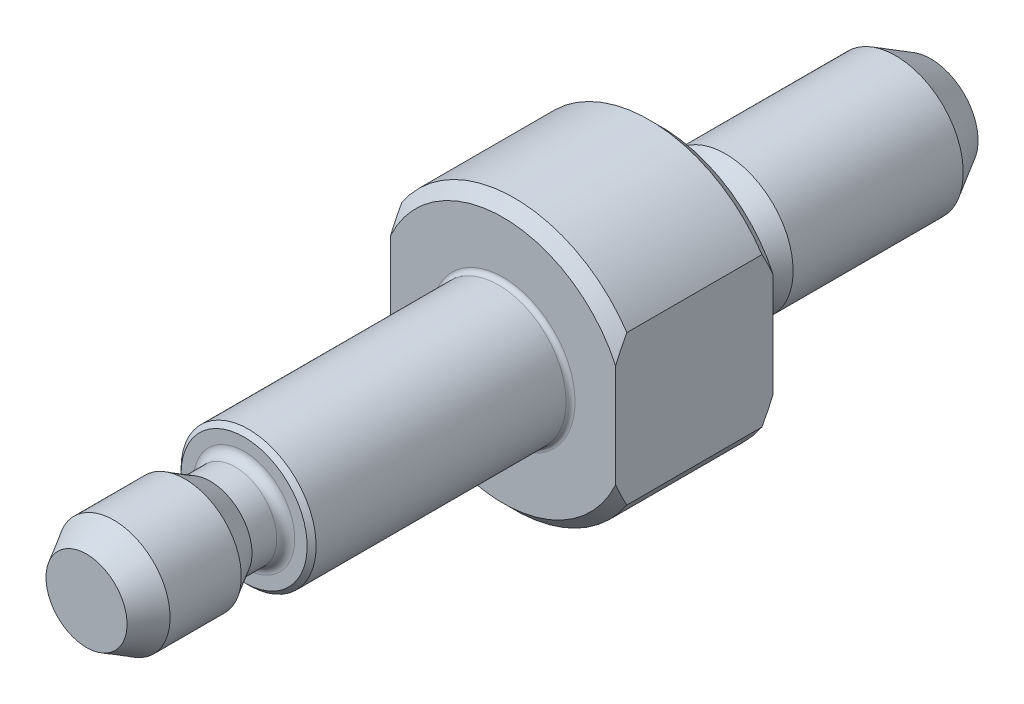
ISO-10303-21;
HEADER;
FILE_DESCRIPTION(('STEP AP214'),'2;1');
FILE_NAME('part.step','',(''),(''),'','','');
FILE_SCHEMA(('AUTOMOTIVE_DESIGN { 1 0 10303 214 1 1 1 1 }'));
ENDSEC;
DATA;
#1=APPLICATION_CONTEXT('core data for automotive mechanical design processes');
#2=APPLICATION_PROTOCOL_DEFINITION('international standard','automotive_design',2000,#1);
#3=PRODUCT_CONTEXT('',#1,'mechanical');
#4=PRODUCT('Part','Part','',(#3));
#5=PRODUCT_RELATED_PRODUCT_CATEGORY('part','',(#4));
#6=PRODUCT_DEFINITION_FORMATION('','',#4);
#7=PRODUCT_DEFINITION_CONTEXT('part definition',#1,'design');
#8=PRODUCT_DEFINITION('design','',#6,#7);
#9=PRODUCT_DEFINITION_SHAPE('','',#8);
#10=(LENGTH_UNIT() NAMED_UNIT(*) SI_UNIT(.MILLI.,.METRE.));
#11=(NAMED_UNIT(*) PLANE_ANGLE_UNIT() SI_UNIT($,.RADIAN.));
#12=(NAMED_UNIT(*) SI_UNIT($,.STERADIAN.) SOLID_ANGLE_UNIT());
#13=UNCERTAINTY_MEASURE_WITH_UNIT(LENGTH_MEASURE(1.E-05),#10,'distance_accuracy_value','');
#14=(GEOMETRIC_REPRESENTATION_CONTEXT(3) GLOBAL_UNCERTAINTY_ASSIGNED_CONTEXT((#13)) GLOBAL_UNIT_ASSIGNED_CONTEXT((#10,
#11,#12)) REPRESENTATION_CONTEXT('',''));
#15=CARTESIAN_POINT('',(0.,0.,0.));
#16=DIRECTION('',(0.,0.,1.));
#17=DIRECTION('',(1.,0.,0.));
#18=AXIS2_PLACEMENT_3D('',#15,#16,#17);
#19=CARTESIAN_POINT('',(0.,0.,-15.0287055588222));
#20=DIRECTION('',(0.,0.,-1.));
#21=DIRECTION('',(-1.,0.,0.));
#22=AXIS2_PLACEMENT_3D('',#19,#20,#21);
#23=CYLINDRICAL_SURFACE('',#22,6.);
#24=DIRECTION('',(0.,0.,-1.));
#25=VECTOR('',#24,1.);
#26=CARTESIAN_POINT('',(-5.,3.3166247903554,25.5));
#27=LINE('',#26,#25);
#28=CARTESIAN_POINT('',(-5.,3.3166247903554,6.5));
#29=VERTEX_POINT('',#28);
#30=CARTESIAN_POINT('',(-5.,3.3166247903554,0.5));
#31=VERTEX_POINT('',#30);
#32=EDGE_CURVE('E99',#29,#31,#27,.T.);
#33=ORIENTED_EDGE('',*,*,#32,.F.);
#34=CARTESIAN_POINT('',(0.,0.,6.5));
#35=DIRECTION('',(0.,0.,-1.));
#36=DIRECTION('',(-1.,0.,0.));
#37=AXIS2_PLACEMENT_3D('',#34,#35,#36);
#38=CIRCLE('',#37,6.);
#39=CARTESIAN_POINT('',(5.,3.3166247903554,6.5));
#40=VERTEX_POINT('',#39);
#41=EDGE_CURVE('E87',#29,#40,#38,.T.);
#42=ORIENTED_EDGE('',*,*,#41,.T.);
#43=DIRECTION('',(0.,0.,-1.));
#44=VECTOR('',#43,1.);
#45=CARTESIAN_POINT('',(5.,3.3166247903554,25.5));
#46=LINE('',#45,#44);
#47=CARTESIAN_POINT('',(5.,3.3166247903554,0.5));
#48=VERTEX_POINT('',#47);
#49=EDGE_CURVE('E96',#40,#48,#46,.T.);
#50=ORIENTED_EDGE('',*,*,#49,.T.);
#51=CARTESIAN_POINT('',(0.,0.,0.5));
#52=DIRECTION('',(0.,0.,1.));
#53=DIRECTION('',(1.,0.,0.));
#54=AXIS2_PLACEMENT_3D('',#51,#52,#53);
#55=CIRCLE('',#54,6.);
#56=EDGE_CURVE('E100',#48,#31,#55,.T.);
#57=ORIENTED_EDGE('',*,*,#56,.T.);
#58=EDGE_LOOP('',(#33,#42,#50,#57));
#59=FACE_BOUND('',#58,.T.);
#60=ADVANCED_FACE('F14',(#59),#23,.T.);
#61=CARTESIAN_POINT('',(0.,-1.8,25.5));
#62=DIRECTION('',(0.,0.,-1.));
#63=DIRECTION('',(-1.,0.,0.));
#64=AXIS2_PLACEMENT_3D('',#61,#62,#63);
#65=PLANE('',#64);
#66=CARTESIAN_POINT('',(0.,0.,25.5));
#67=DIRECTION('',(0.,0.,-1.));
#68=DIRECTION('',(-1.,0.,0.));
#69=AXIS2_PLACEMENT_3D('',#66,#67,#68);
#70=CIRCLE('',#69,1.8);
#71=CARTESIAN_POINT('',(-1.8,0.,25.5));
#72=VERTEX_POINT('',#71);
#73=EDGE_CURVE('E115',#72,#72,#70,.T.);
#74=ORIENTED_EDGE('',*,*,#73,.F.);
#75=EDGE_LOOP('',(#74));
#76=FACE_BOUND('',#75,.T.);
#77=ADVANCED_FACE('F251',(#76),#65,.F.);
#78=CARTESIAN_POINT('',(0.,-2.1,-12.));
#79=DIRECTION('',(0.,0.,1.));
#80=DIRECTION('',(1.,0.,0.));
#81=AXIS2_PLACEMENT_3D('',#78,#79,#80);
#82=PLANE('',#81);
#83=CARTESIAN_POINT('',(0.,0.,-12.));
#84=DIRECTION('',(0.,0.,-1.));
#85=DIRECTION('',(-1.,0.,0.));
#86=AXIS2_PLACEMENT_3D('',#83,#84,#85);
#87=CIRCLE('',#86,2.1);
#88=CARTESIAN_POINT('',(-2.1,0.,-12.));
#89=VERTEX_POINT('',#88);
#90=EDGE_CURVE('E137',#89,#89,#87,.T.);
#91=ORIENTED_EDGE('',*,*,#90,.T.);
#92=EDGE_LOOP('',(#91));
#93=FACE_BOUND('',#92,.T.);
#94=ADVANCED_FACE('F257',(#93),#82,.F.);
#95=CARTESIAN_POINT('',(0.,0.,-10.441154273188));
#96=DIRECTION('',(0.,0.,1.));
#97=DIRECTION('',(1.,0.,0.));
#98=AXIS2_PLACEMENT_3D('',#95,#96,#97);
#99=CONICAL_SURFACE('',#98,3.,0.523598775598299);
#100=ORIENTED_EDGE('',*,*,#90,.F.);
#101=EDGE_LOOP('',(#100));
#102=FACE_BOUND('',#101,.T.);
#103=CARTESIAN_POINT('',(0.,0.,-10.441154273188));
#104=DIRECTION('',(0.,0.,-1.));
#105=DIRECTION('',(-1.,0.,0.));
#106=AXIS2_PLACEMENT_3D('',#103,#104,#105);
#107=CIRCLE('',#106,3.);
#108=CARTESIAN_POINT('',(-3.,0.,-10.441154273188));
#109=VERTEX_POINT('',#108);
#110=EDGE_CURVE('E134',#109,#109,#107,.T.);
#111=ORIENTED_EDGE('',*,*,#110,.T.);
#112=EDGE_LOOP('',(#111));
#113=FACE_BOUND('',#112,.T.);
#114=ADVANCED_FACE('F287',(#102,#113),#99,.T.);
#115=CARTESIAN_POINT('',(0.,0.,-15.0287055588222));
#116=DIRECTION('',(0.,0.,-1.));
#117=DIRECTION('',(-1.,0.,0.));
#118=AXIS2_PLACEMENT_3D('',#115,#116,#117);
#119=CYLINDRICAL_SURFACE('',#118,3.);
#120=ORIENTED_EDGE('',*,*,#110,.F.);
#121=EDGE_LOOP('',(#120));
#122=FACE_BOUND('',#121,.T.);
#123=CARTESIAN_POINT('',(0.,0.,-2.8856406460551));
#124=DIRECTION('',(0.,0.,-1.));
#125=DIRECTION('',(-1.,0.,0.));
#126=AXIS2_PLACEMENT_3D('',#123,#124,#125);
#127=CIRCLE('',#126,3.);
#128=CARTESIAN_POINT('',(-3.,0.,-2.8856406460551));
#129=VERTEX_POINT('',#128);
#130=EDGE_CURVE('E131',#129,#129,#127,.T.);
#131=ORIENTED_EDGE('',*,*,#130,.T.);
#132=EDGE_LOOP('',(#131));
#133=FACE_BOUND('',#132,.T.);
#134=ADVANCED_FACE('F283',(#122,#133),#119,.T.);
#135=CARTESIAN_POINT('',(0.,0.,-1.5));
#136=DIRECTION('',(0.,0.,-1.));
#137=DIRECTION('',(-1.,0.,0.));
#138=AXIS2_PLACEMENT_3D('',#135,#136,#137);
#139=CONICAL_SURFACE('',#138,2.2,0.523598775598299);
#140=ORIENTED_EDGE('',*,*,#130,.F.);
#141=EDGE_LOOP('',(#140));
#142=FACE_BOUND('',#141,.T.);
#143=CARTESIAN_POINT('',(0.,0.,-1.5));
#144=DIRECTION('',(0.,0.,-1.));
#145=DIRECTION('',(-1.,0.,0.));
#146=AXIS2_PLACEMENT_3D('',#143,#144,#145);
#147=CIRCLE('',#146,2.2);
#148=CARTESIAN_POINT('',(-2.2,0.,-1.5));
#149=VERTEX_POINT('',#148);
#150=EDGE_CURVE('E128',#149,#149,#147,.T.);
#151=ORIENTED_EDGE('',*,*,#150,.T.);
#152=EDGE_LOOP('',(#151));
#153=FACE_BOUND('',#152,.T.);
#154=ADVANCED_FACE('F276',(#142,#153),#139,.T.);
#155=CARTESIAN_POINT('',(0.,0.,-15.0287055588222));
#156=DIRECTION('',(0.,0.,-1.));
#157=DIRECTION('',(-1.,0.,0.));
#158=AXIS2_PLACEMENT_3D('',#155,#156,#157);
#159=CYLINDRICAL_SURFACE('',#158,2.2);
#160=CARTESIAN_POINT('',(0.,0.,-0.4));
#161=DIRECTION('',(0.,0.,1.));
#162=DIRECTION('',(1.,0.,0.));
#163=AXIS2_PLACEMENT_3D('',#160,#161,#162);
#164=CIRCLE('',#163,2.2);
#165=CARTESIAN_POINT('',(2.2,0.,-0.4));
#166=VERTEX_POINT('',#165);
#167=EDGE_CURVE('E320',#166,#166,#164,.F.);
#168=ORIENTED_EDGE('',*,*,#167,.T.);
#169=EDGE_LOOP('',(#168));
#170=FACE_BOUND('',#169,.T.);
#171=ORIENTED_EDGE('',*,*,#150,.F.);
#172=EDGE_LOOP('',(#171));
#173=FACE_BOUND('',#172,.T.);
#174=ADVANCED_FACE('F270',(#170,#173),#159,.T.);
#175=CARTESIAN_POINT('',(0.,-2.2,0.));
#176=DIRECTION('',(0.,0.,1.));
#177=DIRECTION('',(1.,0.,0.));
#178=AXIS2_PLACEMENT_3D('',#175,#176,#177);
#179=PLANE('',#178);
#180=CARTESIAN_POINT('',(0.,0.,0.));
#181=DIRECTION('',(0.,0.,1.));
#182=DIRECTION('',(1.,0.,0.));
#183=AXIS2_PLACEMENT_3D('',#180,#181,#182);
#184=CIRCLE('',#183,2.6);
#185=CARTESIAN_POINT('',(2.6,0.,0.));
#186=VERTEX_POINT('',#185);
#187=EDGE_CURVE('E317',#186,#186,#184,.T.);
#188=ORIENTED_EDGE('',*,*,#187,.T.);
#189=EDGE_LOOP('',(#188));
#190=FACE_BOUND('',#189,.T.);
#191=DIRECTION('',(0.,1.,0.));
#192=VECTOR('',#191,1.);
#193=CARTESIAN_POINT('',(5.,3.3166247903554,0.));
#194=LINE('',#193,#192);
#195=CARTESIAN_POINT('',(5.,-2.29128784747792,0.));
#196=VERTEX_POINT('',#195);
#197=CARTESIAN_POINT('',(5.,2.29128784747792,0.));
#198=VERTEX_POINT('',#197);
#199=EDGE_CURVE('E109',#196,#198,#194,.T.);
#200=ORIENTED_EDGE('',*,*,#199,.F.);
#201=CARTESIAN_POINT('',(0.,0.,0.));
#202=DIRECTION('',(0.,0.,1.));
#203=DIRECTION('',(1.,0.,0.));
#204=AXIS2_PLACEMENT_3D('',#201,#202,#203);
#205=CIRCLE('',#204,5.5);
#206=CARTESIAN_POINT('',(-5.,-2.29128784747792,0.));
#207=VERTEX_POINT('',#206);
#208=EDGE_CURVE('E203',#196,#207,#205,.F.);
#209=ORIENTED_EDGE('',*,*,#208,.T.);
#210=DIRECTION('',(0.,-1.,0.));
#211=VECTOR('',#210,1.);
#212=CARTESIAN_POINT('',(-5.,3.3166247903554,0.));
#213=LINE('',#212,#211);
#214=CARTESIAN_POINT('',(-5.,2.29128784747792,0.));
#215=VERTEX_POINT('',#214);
#216=EDGE_CURVE('E104',#215,#207,#213,.T.);
#217=ORIENTED_EDGE('',*,*,#216,.F.);
#218=CARTESIAN_POINT('',(0.,0.,0.));
#219=DIRECTION('',(0.,0.,1.));
#220=DIRECTION('',(1.,0.,0.));
#221=AXIS2_PLACEMENT_3D('',#218,#219,#220);
#222=CIRCLE('',#221,5.5);
#223=EDGE_CURVE('E227',#215,#198,#222,.F.);
#224=ORIENTED_EDGE('',*,*,#223,.T.);
#225=EDGE_LOOP('',(#200,#209,#217,#224));
#226=FACE_BOUND('',#225,.T.);
#227=ADVANCED_FACE('F224',(#190,#226),#179,.F.);
#228=DIRECTION('',(0.,0.,-1.));
#229=VECTOR('',#228,1.);
#230=CARTESIAN_POINT('',(-5.,-3.3166247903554,25.5));
#231=LINE('',#230,#229);
#232=CARTESIAN_POINT('',(-5.,-3.3166247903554,6.5));
#233=VERTEX_POINT('',#232);
#234=CARTESIAN_POINT('',(-5.,-3.3166247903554,0.5));
#235=VERTEX_POINT('',#234);
#236=EDGE_CURVE('E113',#233,#235,#231,.T.);
#237=ORIENTED_EDGE('',*,*,#236,.T.);
#238=CARTESIAN_POINT('',(0.,0.,0.5));
#239=DIRECTION('',(0.,0.,1.));
#240=DIRECTION('',(1.,0.,0.));
#241=AXIS2_PLACEMENT_3D('',#238,#239,#240);
#242=CIRCLE('',#241,6.);
#243=CARTESIAN_POINT('',(5.,-3.31662479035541,0.5));
#244=VERTEX_POINT('',#243);
#245=EDGE_CURVE('E37',#235,#244,#242,.T.);
#246=ORIENTED_EDGE('',*,*,#245,.T.);
#247=DIRECTION('',(0.,0.,-1.));
#248=VECTOR('',#247,1.);
#249=CARTESIAN_POINT('',(5.,-3.31662479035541,25.5));
#250=LINE('',#249,#248);
#251=CARTESIAN_POINT('',(5.,-3.31662479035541,6.5));
#252=VERTEX_POINT('',#251);
#253=EDGE_CURVE('E105',#252,#244,#250,.T.);
#254=ORIENTED_EDGE('',*,*,#253,.F.);
#255=CARTESIAN_POINT('',(0.,0.,6.5));
#256=DIRECTION('',(0.,0.,-1.));
#257=DIRECTION('',(-1.,0.,0.));
#258=AXIS2_PLACEMENT_3D('',#255,#256,#257);
#259=CIRCLE('',#258,6.);
#260=EDGE_CURVE('E209',#252,#233,#259,.T.);
#261=ORIENTED_EDGE('',*,*,#260,.T.);
#262=EDGE_LOOP('',(#237,#246,#254,#261));
#263=FACE_BOUND('',#262,.T.);
#264=ADVANCED_FACE('F213',(#263),#23,.T.);
#265=CARTESIAN_POINT('',(0.,-3.,7.));
#266=DIRECTION('',(0.,0.,-1.));
#267=DIRECTION('',(-1.,0.,0.));
#268=AXIS2_PLACEMENT_3D('',#265,#266,#267);
#269=PLANE('',#268);
#270=CARTESIAN_POINT('',(0.,0.,7.));
#271=DIRECTION('',(0.,0.,-1.));
#272=DIRECTION('',(-1.,0.,0.));
#273=AXIS2_PLACEMENT_3D('',#270,#271,#272);
#274=CIRCLE('',#273,3.2);
#275=CARTESIAN_POINT('',(-3.2,0.,7.));
#276=VERTEX_POINT('',#275);
#277=EDGE_CURVE('E334',#276,#276,#274,.T.);
#278=ORIENTED_EDGE('',*,*,#277,.T.);
#279=EDGE_LOOP('',(#278));
#280=FACE_BOUND('',#279,.T.);
#281=DIRECTION('',(0.,-1.,0.));
#282=VECTOR('',#281,1.);
#283=CARTESIAN_POINT('',(-5.,-3.,7.));
#284=LINE('',#283,#282);
#285=CARTESIAN_POINT('',(-5.,2.29128784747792,7.));
#286=VERTEX_POINT('',#285);
#287=CARTESIAN_POINT('',(-5.,-2.29128784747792,7.));
#288=VERTEX_POINT('',#287);
#289=EDGE_CURVE('E140',#286,#288,#284,.T.);
#290=ORIENTED_EDGE('',*,*,#289,.T.);
#291=CARTESIAN_POINT('',(0.,0.,7.));
#292=DIRECTION('',(0.,0.,-1.));
#293=DIRECTION('',(-1.,0.,0.));
#294=AXIS2_PLACEMENT_3D('',#291,#292,#293);
#295=CIRCLE('',#294,5.5);
#296=CARTESIAN_POINT('',(5.,-2.29128784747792,7.));
#297=VERTEX_POINT('',#296);
#298=EDGE_CURVE('E29',#288,#297,#295,.F.);
#299=ORIENTED_EDGE('',*,*,#298,.T.);
#300=DIRECTION('',(0.,1.,0.));
#301=VECTOR('',#300,1.);
#302=CARTESIAN_POINT('',(5.,-3.,7.));
#303=LINE('',#302,#301);
#304=CARTESIAN_POINT('',(5.,2.29128784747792,7.));
#305=VERTEX_POINT('',#304);
#306=EDGE_CURVE('E142',#297,#305,#303,.T.);
#307=ORIENTED_EDGE('',*,*,#306,.T.);
#308=CARTESIAN_POINT('',(0.,0.,7.));
#309=DIRECTION('',(0.,0.,-1.));
#310=DIRECTION('',(-1.,0.,0.));
#311=AXIS2_PLACEMENT_3D('',#308,#309,#310);
#312=CIRCLE('',#311,5.5);
#313=EDGE_CURVE('E88',#305,#286,#312,.F.);
#314=ORIENTED_EDGE('',*,*,#313,.T.);
#315=EDGE_LOOP('',(#290,#299,#307,#314));
#316=FACE_BOUND('',#315,.T.);
#317=ADVANCED_FACE('F240',(#280,#316),#269,.F.);
#318=CARTESIAN_POINT('',(0.,0.,-15.0287055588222));
#319=DIRECTION('',(0.,0.,-1.));
#320=DIRECTION('',(-1.,0.,0.));
#321=AXIS2_PLACEMENT_3D('',#318,#319,#320);
#322=CYLINDRICAL_SURFACE('',#321,3.);
#323=CARTESIAN_POINT('',(0.,0.,18.3));
#324=DIRECTION('',(0.,0.,-1.));
#325=DIRECTION('',(-1.,0.,0.));
#326=AXIS2_PLACEMENT_3D('',#323,#324,#325);
#327=CIRCLE('',#326,3.);
#328=CARTESIAN_POINT('',(-3.,0.,18.3));
#329=VERTEX_POINT('',#328);
#330=EDGE_CURVE('E22',#329,#329,#327,.T.);
#331=ORIENTED_EDGE('',*,*,#330,.T.);
#332=EDGE_LOOP('',(#331));
#333=FACE_BOUND('',#332,.T.);
#334=CARTESIAN_POINT('',(0.,0.,7.2));
#335=DIRECTION('',(0.,0.,-1.));
#336=DIRECTION('',(-1.,0.,0.));
#337=AXIS2_PLACEMENT_3D('',#334,#335,#336);
#338=CIRCLE('',#337,3.);
#339=CARTESIAN_POINT('',(-3.,0.,7.2));
#340=VERTEX_POINT('',#339);
#341=EDGE_CURVE('E333',#340,#340,#338,.F.);
#342=ORIENTED_EDGE('',*,*,#341,.T.);
#343=EDGE_LOOP('',(#342));
#344=FACE_BOUND('',#343,.T.);
#345=ADVANCED_FACE('F268',(#333,#344),#322,.T.);
#346=CARTESIAN_POINT('',(0.,-3.,18.5));
#347=DIRECTION('',(0.,0.,-1.));
#348=DIRECTION('',(-1.,0.,0.));
#349=AXIS2_PLACEMENT_3D('',#346,#347,#348);
#350=PLANE('',#349);
#351=CARTESIAN_POINT('',(0.,0.,18.5));
#352=DIRECTION('',(0.,0.,-1.));
#353=DIRECTION('',(-1.,0.,0.));
#354=AXIS2_PLACEMENT_3D('',#351,#352,#353);
#355=CIRCLE('',#354,2.8);
#356=CARTESIAN_POINT('',(-2.8,0.,18.5));
#357=VERTEX_POINT('',#356);
#358=EDGE_CURVE('E9',#357,#357,#355,.F.);
#359=ORIENTED_EDGE('',*,*,#358,.T.);
#360=EDGE_LOOP('',(#359));
#361=FACE_BOUND('',#360,.T.);
#362=CARTESIAN_POINT('',(0.,0.,18.5));
#363=DIRECTION('',(0.,0.,-1.));
#364=DIRECTION('',(-1.,0.,0.));
#365=AXIS2_PLACEMENT_3D('',#362,#363,#364);
#366=CIRCLE('',#365,2.25);
#367=CARTESIAN_POINT('',(-2.25,0.,18.5));
#368=VERTEX_POINT('',#367);
#369=EDGE_CURVE('E315',#368,#368,#366,.T.);
#370=ORIENTED_EDGE('',*,*,#369,.T.);
#371=EDGE_LOOP('',(#370));
#372=FACE_BOUND('',#371,.T.);
#373=ADVANCED_FACE('F329',(#361,#372),#350,.F.);
#374=CARTESIAN_POINT('',(0.,0.,-15.0287055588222));
#375=DIRECTION('',(0.,0.,-1.));
#376=DIRECTION('',(-1.,0.,0.));
#377=AXIS2_PLACEMENT_3D('',#374,#375,#376);
#378=CYLINDRICAL_SURFACE('',#377,1.85);
#379=CARTESIAN_POINT('',(0.,0.,18.9));
#380=DIRECTION('',(0.,0.,-1.));
#381=DIRECTION('',(-1.,0.,0.));
#382=AXIS2_PLACEMENT_3D('',#379,#380,#381);
#383=CIRCLE('',#382,1.85);
#384=CARTESIAN_POINT('',(-1.85,0.,18.9));
#385=VERTEX_POINT('',#384);
#386=EDGE_CURVE('E312',#385,#385,#383,.F.);
#387=ORIENTED_EDGE('',*,*,#386,.T.);
#388=EDGE_LOOP('',(#387));
#389=FACE_BOUND('',#388,.T.);
#390=CARTESIAN_POINT('',(0.,0.,20.));
#391=DIRECTION('',(0.,0.,-1.));
#392=DIRECTION('',(-1.,0.,0.));
#393=AXIS2_PLACEMENT_3D('',#390,#391,#392);
#394=CIRCLE('',#393,1.85);
#395=CARTESIAN_POINT('',(-1.85,0.,20.));
#396=VERTEX_POINT('',#395);
#397=EDGE_CURVE('E125',#396,#396,#394,.T.);
#398=ORIENTED_EDGE('',*,*,#397,.T.);
#399=EDGE_LOOP('',(#398));
#400=FACE_BOUND('',#399,.T.);
#401=ADVANCED_FACE('F350',(#389,#400),#378,.T.);
#402=CARTESIAN_POINT('',(0.,0.,21.1258330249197));
#403=DIRECTION('',(0.,0.,1.));
#404=DIRECTION('',(1.,0.,0.));
#405=AXIS2_PLACEMENT_3D('',#402,#403,#404);
#406=CONICAL_SURFACE('',#405,2.5,0.523598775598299);
#407=ORIENTED_EDGE('',*,*,#397,.F.);
#408=EDGE_LOOP('',(#407));
#409=FACE_BOUND('',#408,.T.);
#410=CARTESIAN_POINT('',(0.,0.,21.1258330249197));
#411=DIRECTION('',(0.,0.,-1.));
#412=DIRECTION('',(-1.,0.,0.));
#413=AXIS2_PLACEMENT_3D('',#410,#411,#412);
#414=CIRCLE('',#413,2.5);
#415=CARTESIAN_POINT('',(-2.5,0.,21.1258330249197));
#416=VERTEX_POINT('',#415);
#417=EDGE_CURVE('E122',#416,#416,#414,.T.);
#418=ORIENTED_EDGE('',*,*,#417,.T.);
#419=EDGE_LOOP('',(#418));
#420=FACE_BOUND('',#419,.T.);
#421=ADVANCED_FACE('F356',(#409,#420),#406,.T.);
#422=CARTESIAN_POINT('',(0.,0.,-15.0287055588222));
#423=DIRECTION('',(0.,0.,-1.));
#424=DIRECTION('',(-1.,0.,0.));
#425=AXIS2_PLACEMENT_3D('',#422,#423,#424);
#426=CYLINDRICAL_SURFACE('',#425,2.5);
#427=ORIENTED_EDGE('',*,*,#417,.F.);
#428=EDGE_LOOP('',(#427));
#429=FACE_BOUND('',#428,.T.);
#430=CARTESIAN_POINT('',(0.,0.,24.2875644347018));
#431=DIRECTION('',(0.,0.,-1.));
#432=DIRECTION('',(-1.,0.,0.));
#433=AXIS2_PLACEMENT_3D('',#430,#431,#432);
#434=CIRCLE('',#433,2.5);
#435=CARTESIAN_POINT('',(-2.5,0.,24.2875644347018));
#436=VERTEX_POINT('',#435);
#437=EDGE_CURVE('E119',#436,#436,#434,.T.);
#438=ORIENTED_EDGE('',*,*,#437,.T.);
#439=EDGE_LOOP('',(#438));
#440=FACE_BOUND('',#439,.T.);
#441=ADVANCED_FACE('F360',(#429,#440),#426,.T.);
#442=CARTESIAN_POINT('',(0.,0.,25.5));
#443=DIRECTION('',(0.,0.,-1.));
#444=DIRECTION('',(-1.,0.,0.));
#445=AXIS2_PLACEMENT_3D('',#442,#443,#444);
#446=CONICAL_SURFACE('',#445,1.8,0.523598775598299);
#447=ORIENTED_EDGE('',*,*,#437,.F.);
#448=EDGE_LOOP('',(#447));
#449=FACE_BOUND('',#448,.T.);
#450=ORIENTED_EDGE('',*,*,#73,.T.);
#451=EDGE_LOOP('',(#450));
#452=FACE_BOUND('',#451,.T.);
#453=ADVANCED_FACE('F363',(#449,#452),#446,.T.);
#454=CARTESIAN_POINT('',(-5.,3.3166247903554,25.5));
#455=DIRECTION('',(1.,0.,0.));
#456=DIRECTION('',(0.,0.,-1.));
#457=AXIS2_PLACEMENT_3D('',#454,#455,#456);
#458=PLANE('',#457);
#459=ORIENTED_EDGE('',*,*,#216,.T.);
#460=CARTESIAN_POINT('',(-5.,-2.29128784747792,0.));
#461=CARTESIAN_POINT('',(-5.,-2.3791264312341,0.0365976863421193));
#462=CARTESIAN_POINT('',(-5.,-2.46634159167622,0.0746660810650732));
#463=CARTESIAN_POINT('',(-5.,-2.63950876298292,0.153410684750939));
#464=CARTESIAN_POINT('',(-5.,-2.72546167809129,0.194084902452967));
#465=CARTESIAN_POINT('',(-5.,-2.8962115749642,0.277759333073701));
#466=CARTESIAN_POINT('',(-5.,-2.98100867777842,0.320759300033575));
#467=CARTESIAN_POINT('',(-5.,-3.14958298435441,0.408867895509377));
#468=CARTESIAN_POINT('',(-5.,-3.23335936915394,0.453978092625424));
#469=CARTESIAN_POINT('',(-5.,-3.3166247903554,0.5));
#470=B_SPLINE_CURVE_WITH_KNOTS('',3,(#460,#461,#462,#463,#464,#465,#466,#467,#468,#469),
.UNSPECIFIED.,.F.,.F.,(4,2,2,2,4),(0.,0.285445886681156,0.57067619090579,0.855876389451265,
1.14129206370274),.UNSPECIFIED.);
#471=EDGE_CURVE('E202',#207,#235,#470,.T.);
#472=ORIENTED_EDGE('',*,*,#471,.T.);
#473=ORIENTED_EDGE('',*,*,#236,.F.);
#474=CARTESIAN_POINT('',(-5.,-3.3166247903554,6.5));
#475=CARTESIAN_POINT('',(-5.,-3.23335936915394,6.54602190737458));
#476=CARTESIAN_POINT('',(-5.,-3.14958298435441,6.59113210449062));
#477=CARTESIAN_POINT('',(-5.,-2.98100867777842,6.67924069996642));
#478=CARTESIAN_POINT('',(-5.,-2.8962115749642,6.7222406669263));
#479=CARTESIAN_POINT('',(-5.,-2.72546167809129,6.80591509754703));
#480=CARTESIAN_POINT('',(-5.,-2.63950876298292,6.84658931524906));
#481=CARTESIAN_POINT('',(-5.,-2.46634159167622,6.92533391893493));
#482=CARTESIAN_POINT('',(-5.,-2.3791264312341,6.96340231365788));
#483=CARTESIAN_POINT('',(-5.,-2.29128784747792,7.));
#484=B_SPLINE_CURVE_WITH_KNOTS('',3,(#474,#475,#476,#477,#478,#479,#480,#481,#482,#483),
.UNSPECIFIED.,.F.,.F.,(4,2,2,2,4),(0.,0.285415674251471,0.570615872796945,0.855846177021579,
1.14129206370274),.UNSPECIFIED.);
#485=EDGE_CURVE('E195',#233,#288,#484,.T.);
#486=ORIENTED_EDGE('',*,*,#485,.T.);
#487=ORIENTED_EDGE('',*,*,#289,.F.);
#488=CARTESIAN_POINT('',(-5.,2.29128784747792,7.));
#489=CARTESIAN_POINT('',(-5.,2.3791264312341,6.96340231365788));
#490=CARTESIAN_POINT('',(-5.,2.46634159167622,6.92533391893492));
#491=CARTESIAN_POINT('',(-5.,2.63950876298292,6.84658931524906));
#492=CARTESIAN_POINT('',(-5.,2.72546167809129,6.80591509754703));
#493=CARTESIAN_POINT('',(-5.,2.89621157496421,6.7222406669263));
#494=CARTESIAN_POINT('',(-5.,2.98100867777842,6.67924069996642));
#495=CARTESIAN_POINT('',(-5.,3.14958298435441,6.59113210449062));
#496=CARTESIAN_POINT('',(-5.,3.23335936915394,6.54602190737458));
#497=CARTESIAN_POINT('',(-5.,3.3166247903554,6.5));
#498=B_SPLINE_CURVE_WITH_KNOTS('',3,(#488,#489,#490,#491,#492,#493,#494,#495,#496,#497),
.UNSPECIFIED.,.F.,.F.,(4,2,2,2,4),(0.,0.285445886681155,0.570676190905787,0.855876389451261,
1.14129206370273),.UNSPECIFIED.);
#499=EDGE_CURVE('E228',#286,#29,#498,.T.);
#500=ORIENTED_EDGE('',*,*,#499,.T.);
#501=ORIENTED_EDGE('',*,*,#32,.T.);
#502=CARTESIAN_POINT('',(-5.,3.3166247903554,0.5));
#503=CARTESIAN_POINT('',(-5.,3.23335936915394,0.453978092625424));
#504=CARTESIAN_POINT('',(-5.,3.14958298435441,0.408867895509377));
#505=CARTESIAN_POINT('',(-5.,2.98100867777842,0.320759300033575));
#506=CARTESIAN_POINT('',(-5.,2.8962115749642,0.277759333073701));
#507=CARTESIAN_POINT('',(-5.,2.72546167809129,0.194084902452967));
#508=CARTESIAN_POINT('',(-5.,2.63950876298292,0.153410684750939));
#509=CARTESIAN_POINT('',(-5.,2.46634159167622,0.0746660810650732));
#510=CARTESIAN_POINT('',(-5.,2.3791264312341,0.0365976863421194));
#511=CARTESIAN_POINT('',(-5.,2.29128784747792,0.));
#512=B_SPLINE_CURVE_WITH_KNOTS('',3,(#502,#503,#504,#505,#506,#507,#508,#509,#510,#511),
.UNSPECIFIED.,.F.,.F.,(4,2,2,2,4),(0.,0.28541567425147,0.570615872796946,0.85584617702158,
1.14129206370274),.UNSPECIFIED.);
#513=EDGE_CURVE('E229',#31,#215,#512,.T.);
#514=ORIENTED_EDGE('',*,*,#513,.T.);
#515=EDGE_LOOP('',(#459,#472,#473,#486,#487,#500,#501,#514));
#516=FACE_BOUND('',#515,.T.);
#517=ADVANCED_FACE('F163',(#516),#458,.F.);
#518=CARTESIAN_POINT('',(5.,3.3166247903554,25.5));
#519=DIRECTION('',(-1.,0.,0.));
#520=DIRECTION('',(0.,1.,0.));
#521=AXIS2_PLACEMENT_3D('',#518,#519,#520);
#522=PLANE('',#521);
#523=ORIENTED_EDGE('',*,*,#253,.T.);
#524=CARTESIAN_POINT('',(5.,-3.31662479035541,0.5));
#525=CARTESIAN_POINT('',(5.,-3.23335936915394,0.453978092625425));
#526=CARTESIAN_POINT('',(5.,-3.14958298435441,0.408867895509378));
#527=CARTESIAN_POINT('',(5.,-2.98100867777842,0.320759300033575));
#528=CARTESIAN_POINT('',(5.,-2.89621157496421,0.277759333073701));
#529=CARTESIAN_POINT('',(5.,-2.72546167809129,0.194084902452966));
#530=CARTESIAN_POINT('',(5.,-2.63950876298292,0.153410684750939));
#531=CARTESIAN_POINT('',(5.,-2.46634159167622,0.0746660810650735));
#532=CARTESIAN_POINT('',(5.,-2.3791264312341,0.0365976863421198));
#533=CARTESIAN_POINT('',(5.,-2.29128784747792,0.));
#534=B_SPLINE_CURVE_WITH_KNOTS('',3,(#524,#525,#526,#527,#528,#529,#530,#531,#532,#533),
.UNSPECIFIED.,.F.,.F.,(4,2,2,2,4),(0.,0.285415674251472,0.570615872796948,0.855846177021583,
1.14129206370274),.UNSPECIFIED.);
#535=EDGE_CURVE('E179',#244,#196,#534,.T.);
#536=ORIENTED_EDGE('',*,*,#535,.T.);
#537=ORIENTED_EDGE('',*,*,#199,.T.);
#538=CARTESIAN_POINT('',(5.,2.29128784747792,0.));
#539=CARTESIAN_POINT('',(5.,2.3791264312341,0.0365976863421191));
#540=CARTESIAN_POINT('',(5.,2.46634159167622,0.0746660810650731));
#541=CARTESIAN_POINT('',(5.,2.63950876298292,0.153410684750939));
#542=CARTESIAN_POINT('',(5.,2.72546167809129,0.194084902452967));
#543=CARTESIAN_POINT('',(5.,2.8962115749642,0.277759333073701));
#544=CARTESIAN_POINT('',(5.,2.98100867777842,0.320759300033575));
#545=CARTESIAN_POINT('',(5.,3.14958298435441,0.408867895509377));
#546=CARTESIAN_POINT('',(5.,3.23335936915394,0.453978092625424));
#547=CARTESIAN_POINT('',(5.,3.3166247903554,0.5));
#548=B_SPLINE_CURVE_WITH_KNOTS('',3,(#538,#539,#540,#541,#542,#543,#544,#545,#546,#547),
.UNSPECIFIED.,.F.,.F.,(4,2,2,2,4),(0.,0.285445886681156,0.57067619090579,0.855876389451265,
1.14129206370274),.UNSPECIFIED.);
#549=EDGE_CURVE('E91',#198,#48,#548,.T.);
#550=ORIENTED_EDGE('',*,*,#549,.T.);
#551=ORIENTED_EDGE('',*,*,#49,.F.);
#552=CARTESIAN_POINT('',(5.,3.3166247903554,6.5));
#553=CARTESIAN_POINT('',(5.,3.23335936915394,6.54602190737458));
#554=CARTESIAN_POINT('',(5.,3.14958298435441,6.59113210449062));
#555=CARTESIAN_POINT('',(5.,2.98100867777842,6.67924069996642));
#556=CARTESIAN_POINT('',(5.,2.8962115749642,6.7222406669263));
#557=CARTESIAN_POINT('',(5.,2.72546167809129,6.80591509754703));
#558=CARTESIAN_POINT('',(5.,2.63950876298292,6.84658931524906));
#559=CARTESIAN_POINT('',(5.,2.46634159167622,6.92533391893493));
#560=CARTESIAN_POINT('',(5.,2.3791264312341,6.96340231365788));
#561=CARTESIAN_POINT('',(5.,2.29128784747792,7.));
#562=B_SPLINE_CURVE_WITH_KNOTS('',3,(#552,#553,#554,#555,#556,#557,#558,#559,#560,#561),
.UNSPECIFIED.,.F.,.F.,(4,2,2,2,4),(0.,0.285415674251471,0.570615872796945,0.855846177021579,
1.14129206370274),.UNSPECIFIED.);
#563=EDGE_CURVE('E83',#40,#305,#562,.T.);
#564=ORIENTED_EDGE('',*,*,#563,.T.);
#565=ORIENTED_EDGE('',*,*,#306,.F.);
#566=CARTESIAN_POINT('',(5.,-2.29128784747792,7.));
#567=CARTESIAN_POINT('',(5.,-2.3791264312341,6.96340231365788));
#568=CARTESIAN_POINT('',(5.,-2.46634159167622,6.92533391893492));
#569=CARTESIAN_POINT('',(5.,-2.63950876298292,6.84658931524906));
#570=CARTESIAN_POINT('',(5.,-2.72546167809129,6.80591509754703));
#571=CARTESIAN_POINT('',(5.,-2.89621157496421,6.7222406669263));
#572=CARTESIAN_POINT('',(5.,-2.98100867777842,6.67924069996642));
#573=CARTESIAN_POINT('',(5.,-3.14958298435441,6.59113210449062));
#574=CARTESIAN_POINT('',(5.,-3.23335936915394,6.54602190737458));
#575=CARTESIAN_POINT('',(5.,-3.31662479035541,6.5));
#576=B_SPLINE_CURVE_WITH_KNOTS('',3,(#566,#567,#568,#569,#570,#571,#572,#573,#574,#575),
.UNSPECIFIED.,.F.,.F.,(4,2,2,2,4),(0.,0.285445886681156,0.57067619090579,0.855876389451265,
1.14129206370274),.UNSPECIFIED.);
#577=EDGE_CURVE('E172',#297,#252,#576,.T.);
#578=ORIENTED_EDGE('',*,*,#577,.T.);
#579=EDGE_LOOP('',(#523,#536,#537,#550,#551,#564,#565,#578));
#580=FACE_BOUND('',#579,.T.);
#581=ADVANCED_FACE('F102',(#580),#522,.F.);
#582=CARTESIAN_POINT('',(0.,0.,6.5));
#583=DIRECTION('',(0.,0.,-1.));
#584=DIRECTION('',(-1.,0.,0.));
#585=AXIS2_PLACEMENT_3D('',#582,#583,#584);
#586=CONICAL_SURFACE('',#585,6.,0.785398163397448);
#587=ORIENTED_EDGE('',*,*,#499,.F.);
#588=ORIENTED_EDGE('',*,*,#313,.F.);
#589=ORIENTED_EDGE('',*,*,#563,.F.);
#590=ORIENTED_EDGE('',*,*,#41,.F.);
#591=EDGE_LOOP('',(#587,#588,#589,#590));
#592=FACE_BOUND('',#591,.T.);
#593=ADVANCED_FACE('F86',(#592),#586,.T.);
#594=CARTESIAN_POINT('',(0.,0.,0.));
#595=DIRECTION('',(0.,0.,1.));
#596=DIRECTION('',(1.,0.,0.));
#597=AXIS2_PLACEMENT_3D('',#594,#595,#596);
#598=CONICAL_SURFACE('',#597,5.5,0.785398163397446);
#599=ORIENTED_EDGE('',*,*,#513,.F.);
#600=ORIENTED_EDGE('',*,*,#56,.F.);
#601=ORIENTED_EDGE('',*,*,#549,.F.);
#602=ORIENTED_EDGE('',*,*,#223,.F.);
#603=EDGE_LOOP('',(#599,#600,#601,#602));
#604=FACE_BOUND('',#603,.T.);
#605=ADVANCED_FACE('F157',(#604),#598,.T.);
#606=CARTESIAN_POINT('',(0.,0.,0.));
#607=DIRECTION('',(0.,0.,1.));
#608=DIRECTION('',(1.,0.,0.));
#609=AXIS2_PLACEMENT_3D('',#606,#607,#608);
#610=CONICAL_SURFACE('',#609,5.5,0.785398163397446);
#611=ORIENTED_EDGE('',*,*,#535,.F.);
#612=ORIENTED_EDGE('',*,*,#245,.F.);
#613=ORIENTED_EDGE('',*,*,#471,.F.);
#614=ORIENTED_EDGE('',*,*,#208,.F.);
#615=EDGE_LOOP('',(#611,#612,#613,#614));
#616=FACE_BOUND('',#615,.T.);
#617=ADVANCED_FACE('F190',(#616),#610,.T.);
#618=CARTESIAN_POINT('',(0.,0.,6.5));
#619=DIRECTION('',(0.,0.,-1.));
#620=DIRECTION('',(-1.,0.,0.));
#621=AXIS2_PLACEMENT_3D('',#618,#619,#620);
#622=CONICAL_SURFACE('',#621,6.,0.785398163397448);
#623=ORIENTED_EDGE('',*,*,#577,.F.);
#624=ORIENTED_EDGE('',*,*,#298,.F.);
#625=ORIENTED_EDGE('',*,*,#485,.F.);
#626=ORIENTED_EDGE('',*,*,#260,.F.);
#627=EDGE_LOOP('',(#623,#624,#625,#626));
#628=FACE_BOUND('',#627,.T.);
#629=ADVANCED_FACE('F186',(#628),#622,.T.);
#630=CARTESIAN_POINT('',(0.,0.,7.2));
#631=DIRECTION('',(0.,0.,-1.));
#632=DIRECTION('',(-1.,0.,0.));
#633=AXIS2_PLACEMENT_3D('',#630,#631,#632);
#634=TOROIDAL_SURFACE('',#633,3.2,0.2);
#635=ORIENTED_EDGE('',*,*,#341,.F.);
#636=EDGE_LOOP('',(#635));
#637=FACE_BOUND('',#636,.T.);
#638=ORIENTED_EDGE('',*,*,#277,.F.);
#639=EDGE_LOOP('',(#638));
#640=FACE_BOUND('',#639,.T.);
#641=ADVANCED_FACE('F189',(#637,#640),#634,.F.);
#642=CARTESIAN_POINT('',(0.,0.,-0.4));
#643=DIRECTION('',(0.,0.,1.));
#644=DIRECTION('',(1.,0.,0.));
#645=AXIS2_PLACEMENT_3D('',#642,#643,#644);
#646=TOROIDAL_SURFACE('',#645,2.6,0.4);
#647=ORIENTED_EDGE('',*,*,#187,.F.);
#648=EDGE_LOOP('',(#647));
#649=FACE_BOUND('',#648,.T.);
#650=ORIENTED_EDGE('',*,*,#167,.F.);
#651=EDGE_LOOP('',(#650));
#652=FACE_BOUND('',#651,.T.);
#653=ADVANCED_FACE('F297',(#649,#652),#646,.F.);
#654=CARTESIAN_POINT('',(0.,0.,18.9));
#655=DIRECTION('',(0.,0.,-1.));
#656=DIRECTION('',(-1.,0.,0.));
#657=AXIS2_PLACEMENT_3D('',#654,#655,#656);
#658=TOROIDAL_SURFACE('',#657,2.25,0.4);
#659=ORIENTED_EDGE('',*,*,#386,.F.);
#660=EDGE_LOOP('',(#659));
#661=FACE_BOUND('',#660,.T.);
#662=ORIENTED_EDGE('',*,*,#369,.F.);
#663=EDGE_LOOP('',(#662));
#664=FACE_BOUND('',#663,.T.);
#665=ADVANCED_FACE('F300',(#661,#664),#658,.F.);
#666=CARTESIAN_POINT('',(0.,0.,18.3));
#667=DIRECTION('',(0.,0.,-1.));
#668=DIRECTION('',(-1.,0.,0.));
#669=AXIS2_PLACEMENT_3D('',#666,#667,#668);
#670=CONICAL_SURFACE('',#669,3.,0.78539816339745);
#671=ORIENTED_EDGE('',*,*,#358,.F.);
#672=EDGE_LOOP('',(#671));
#673=FACE_BOUND('',#672,.T.);
#674=ORIENTED_EDGE('',*,*,#330,.F.);
#675=EDGE_LOOP('',(#674));
#676=FACE_BOUND('',#675,.T.);
#677=ADVANCED_FACE('F16',(#673,#676),#670,.T.);
#678=CLOSED_SHELL('',(#60,#77,#94,#114,#134,#154,#174,#227,#264,#317,#345,#373,#401,#421,#441,
#453,#517,#581,#593,#605,#617,#629,#641,#653,#665,#677));
#679=MANIFOLD_SOLID_BREP('B1',#678);
#680=ADVANCED_BREP_SHAPE_REPRESENTATION('',(#18,#679),#14);
#681=SHAPE_DEFINITION_REPRESENTATION(#9,#680);
ENDSEC;
END-ISO-10303-21;
